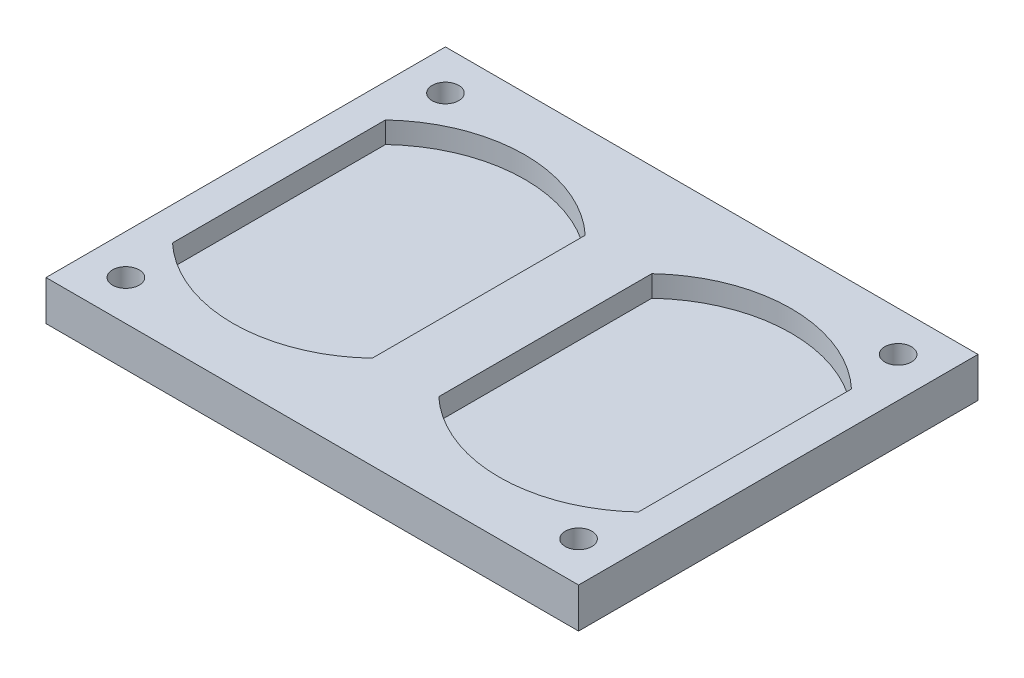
ISO-10303-21;
HEADER;
FILE_DESCRIPTION(('STEP AP214'),'2;1');
FILE_NAME('part.step','',(''),(''),'','','');
FILE_SCHEMA(('AUTOMOTIVE_DESIGN { 1 0 10303 214 1 1 1 1 }'));
ENDSEC;
DATA;
#1=APPLICATION_CONTEXT('core data for automotive mechanical design processes');
#2=APPLICATION_PROTOCOL_DEFINITION('international standard','automotive_design',2000,#1);
#3=PRODUCT_CONTEXT('',#1,'mechanical');
#4=PRODUCT('Part','Part','',(#3));
#5=PRODUCT_RELATED_PRODUCT_CATEGORY('part','',(#4));
#6=PRODUCT_DEFINITION_FORMATION('','',#4);
#7=PRODUCT_DEFINITION_CONTEXT('part definition',#1,'design');
#8=PRODUCT_DEFINITION('design','',#6,#7);
#9=PRODUCT_DEFINITION_SHAPE('','',#8);
#10=(LENGTH_UNIT() NAMED_UNIT(*) SI_UNIT(.MILLI.,.METRE.));
#11=(NAMED_UNIT(*) PLANE_ANGLE_UNIT() SI_UNIT($,.RADIAN.));
#12=(NAMED_UNIT(*) SI_UNIT($,.STERADIAN.) SOLID_ANGLE_UNIT());
#13=UNCERTAINTY_MEASURE_WITH_UNIT(LENGTH_MEASURE(1.E-05),#10,'distance_accuracy_value','');
#14=(GEOMETRIC_REPRESENTATION_CONTEXT(3) GLOBAL_UNCERTAINTY_ASSIGNED_CONTEXT((#13)) GLOBAL_UNIT_ASSIGNED_CONTEXT((#10,
#11,#12)) REPRESENTATION_CONTEXT('',''));
#15=CARTESIAN_POINT('',(0.,0.,0.));
#16=DIRECTION('',(0.,0.,1.));
#17=DIRECTION('',(1.,0.,0.));
#18=AXIS2_PLACEMENT_3D('',#15,#16,#17);
#19=CARTESIAN_POINT('',(100.,15.,75.));
#20=DIRECTION('',(-1.,0.,0.));
#21=DIRECTION('',(0.,0.,1.));
#22=AXIS2_PLACEMENT_3D('',#19,#20,#21);
#23=PLANE('',#22);
#24=DIRECTION('',(0.,0.,-1.));
#25=VECTOR('',#24,1.);
#26=CARTESIAN_POINT('',(100.,0.,75.));
#27=LINE('',#26,#25);
#28=CARTESIAN_POINT('',(100.,0.,75.));
#29=VERTEX_POINT('',#28);
#30=CARTESIAN_POINT('',(100.,0.,-75.));
#31=VERTEX_POINT('',#30);
#32=EDGE_CURVE('E187',#29,#31,#27,.T.);
#33=ORIENTED_EDGE('',*,*,#32,.T.);
#34=DIRECTION('',(0.,-1.,0.));
#35=VECTOR('',#34,1.);
#36=CARTESIAN_POINT('',(100.,15.,-75.));
#37=LINE('',#36,#35);
#38=CARTESIAN_POINT('',(100.,15.,-75.));
#39=VERTEX_POINT('',#38);
#40=EDGE_CURVE('E12',#39,#31,#37,.T.);
#41=ORIENTED_EDGE('',*,*,#40,.F.);
#42=DIRECTION('',(0.,0.,-1.));
#43=VECTOR('',#42,1.);
#44=CARTESIAN_POINT('',(100.,15.,75.));
#45=LINE('',#44,#43);
#46=CARTESIAN_POINT('',(100.,15.,75.));
#47=VERTEX_POINT('',#46);
#48=EDGE_CURVE('E244',#47,#39,#45,.T.);
#49=ORIENTED_EDGE('',*,*,#48,.F.);
#50=DIRECTION('',(0.,-1.,0.));
#51=VECTOR('',#50,1.);
#52=CARTESIAN_POINT('',(100.,15.,75.));
#53=LINE('',#52,#51);
#54=EDGE_CURVE('E254',#47,#29,#53,.T.);
#55=ORIENTED_EDGE('',*,*,#54,.T.);
#56=EDGE_LOOP('',(#33,#41,#49,#55));
#57=FACE_BOUND('',#56,.T.);
#58=ADVANCED_FACE('F39',(#57),#23,.F.);
#59=CARTESIAN_POINT('',(-100.,15.,-75.));
#60=DIRECTION('',(0.,0.,1.));
#61=DIRECTION('',(1.,0.,0.));
#62=AXIS2_PLACEMENT_3D('',#59,#60,#61);
#63=PLANE('',#62);
#64=DIRECTION('',(-1.,0.,0.));
#65=VECTOR('',#64,1.);
#66=CARTESIAN_POINT('',(-100.,0.,-75.));
#67=LINE('',#66,#65);
#68=CARTESIAN_POINT('',(-100.,0.,-75.));
#69=VERTEX_POINT('',#68);
#70=EDGE_CURVE('E257',#31,#69,#67,.T.);
#71=ORIENTED_EDGE('',*,*,#70,.T.);
#72=DIRECTION('',(0.,-1.,0.));
#73=VECTOR('',#72,1.);
#74=CARTESIAN_POINT('',(-100.,15.,-75.));
#75=LINE('',#74,#73);
#76=CARTESIAN_POINT('',(-100.,15.,-75.));
#77=VERTEX_POINT('',#76);
#78=EDGE_CURVE('E46',#77,#69,#75,.T.);
#79=ORIENTED_EDGE('',*,*,#78,.F.);
#80=DIRECTION('',(-1.,0.,0.));
#81=VECTOR('',#80,1.);
#82=CARTESIAN_POINT('',(-100.,15.,-75.));
#83=LINE('',#82,#81);
#84=EDGE_CURVE('E247',#39,#77,#83,.T.);
#85=ORIENTED_EDGE('',*,*,#84,.F.);
#86=ORIENTED_EDGE('',*,*,#40,.T.);
#87=EDGE_LOOP('',(#71,#79,#85,#86));
#88=FACE_BOUND('',#87,.T.);
#89=ADVANCED_FACE('F288',(#88),#63,.F.);
#90=CARTESIAN_POINT('',(-100.,15.,75.));
#91=DIRECTION('',(1.,0.,0.));
#92=DIRECTION('',(0.,0.,-1.));
#93=AXIS2_PLACEMENT_3D('',#90,#91,#92);
#94=PLANE('',#93);
#95=DIRECTION('',(0.,0.,1.));
#96=VECTOR('',#95,1.);
#97=CARTESIAN_POINT('',(-100.,0.,75.));
#98=LINE('',#97,#96);
#99=CARTESIAN_POINT('',(-100.,0.,75.));
#100=VERTEX_POINT('',#99);
#101=EDGE_CURVE('E259',#69,#100,#98,.T.);
#102=ORIENTED_EDGE('',*,*,#101,.T.);
#103=DIRECTION('',(0.,-1.,0.));
#104=VECTOR('',#103,1.);
#105=CARTESIAN_POINT('',(-100.,15.,75.));
#106=LINE('',#105,#104);
#107=CARTESIAN_POINT('',(-100.,15.,75.));
#108=VERTEX_POINT('',#107);
#109=EDGE_CURVE('E263',#108,#100,#106,.T.);
#110=ORIENTED_EDGE('',*,*,#109,.F.);
#111=DIRECTION('',(0.,0.,1.));
#112=VECTOR('',#111,1.);
#113=CARTESIAN_POINT('',(-100.,15.,75.));
#114=LINE('',#113,#112);
#115=EDGE_CURVE('E250',#77,#108,#114,.T.);
#116=ORIENTED_EDGE('',*,*,#115,.F.);
#117=ORIENTED_EDGE('',*,*,#78,.T.);
#118=EDGE_LOOP('',(#102,#110,#116,#117));
#119=FACE_BOUND('',#118,.T.);
#120=ADVANCED_FACE('F272',(#119),#94,.F.);
#121=CARTESIAN_POINT('',(-100.,15.,75.));
#122=DIRECTION('',(0.,0.,-1.));
#123=DIRECTION('',(-1.,0.,0.));
#124=AXIS2_PLACEMENT_3D('',#121,#122,#123);
#125=PLANE('',#124);
#126=DIRECTION('',(1.,0.,0.));
#127=VECTOR('',#126,1.);
#128=CARTESIAN_POINT('',(-100.,0.,75.));
#129=LINE('',#128,#127);
#130=EDGE_CURVE('E248',#100,#29,#129,.T.);
#131=ORIENTED_EDGE('',*,*,#130,.T.);
#132=ORIENTED_EDGE('',*,*,#54,.F.);
#133=DIRECTION('',(1.,0.,0.));
#134=VECTOR('',#133,1.);
#135=CARTESIAN_POINT('',(-100.,15.,75.));
#136=LINE('',#135,#134);
#137=EDGE_CURVE('E252',#108,#47,#136,.T.);
#138=ORIENTED_EDGE('',*,*,#137,.F.);
#139=ORIENTED_EDGE('',*,*,#109,.T.);
#140=EDGE_LOOP('',(#131,#132,#138,#139));
#141=FACE_BOUND('',#140,.T.);
#142=ADVANCED_FACE('F281',(#141),#125,.F.);
#143=CARTESIAN_POINT('',(0.,15.,0.));
#144=DIRECTION('',(0.,-1.,0.));
#145=DIRECTION('',(0.,0.,-1.));
#146=AXIS2_PLACEMENT_3D('',#143,#144,#145);
#147=PLANE('',#146);
#148=CARTESIAN_POINT('',(-85.,15.,-60.));
#149=DIRECTION('',(0.,1.,0.));
#150=DIRECTION('',(0.,0.,1.));
#151=AXIS2_PLACEMENT_3D('',#148,#149,#150);
#152=CIRCLE('',#151,5.);
#153=CARTESIAN_POINT('',(-85.,15.,-55.));
#154=VERTEX_POINT('',#153);
#155=EDGE_CURVE('E360',#154,#154,#152,.T.);
#156=ORIENTED_EDGE('',*,*,#155,.F.);
#157=EDGE_LOOP('',(#156));
#158=FACE_BOUND('',#157,.T.);
#159=CARTESIAN_POINT('',(85.,15.,-60.));
#160=DIRECTION('',(0.,1.,0.));
#161=DIRECTION('',(0.,0.,1.));
#162=AXIS2_PLACEMENT_3D('',#159,#160,#161);
#163=CIRCLE('',#162,5.);
#164=CARTESIAN_POINT('',(85.,15.,-55.));
#165=VERTEX_POINT('',#164);
#166=EDGE_CURVE('E362',#165,#165,#163,.T.);
#167=ORIENTED_EDGE('',*,*,#166,.F.);
#168=EDGE_LOOP('',(#167));
#169=FACE_BOUND('',#168,.T.);
#170=CARTESIAN_POINT('',(85.,15.,60.));
#171=DIRECTION('',(0.,1.,0.));
#172=DIRECTION('',(0.,0.,1.));
#173=AXIS2_PLACEMENT_3D('',#170,#171,#172);
#174=CIRCLE('',#173,5.);
#175=CARTESIAN_POINT('',(85.,15.,65.));
#176=VERTEX_POINT('',#175);
#177=EDGE_CURVE('E370',#176,#176,#174,.T.);
#178=ORIENTED_EDGE('',*,*,#177,.F.);
#179=EDGE_LOOP('',(#178));
#180=FACE_BOUND('',#179,.T.);
#181=CARTESIAN_POINT('',(-85.,15.,60.));
#182=DIRECTION('',(0.,1.,0.));
#183=DIRECTION('',(0.,0.,1.));
#184=AXIS2_PLACEMENT_3D('',#181,#182,#183);
#185=CIRCLE('',#184,5.);
#186=CARTESIAN_POINT('',(-85.,15.,65.));
#187=VERTEX_POINT('',#186);
#188=EDGE_CURVE('E375',#187,#187,#185,.T.);
#189=ORIENTED_EDGE('',*,*,#188,.F.);
#190=EDGE_LOOP('',(#189));
#191=FACE_BOUND('',#190,.T.);
#192=DIRECTION('',(0.,0.,1.));
#193=VECTOR('',#192,1.);
#194=CARTESIAN_POINT('',(-87.5,15.,40.0000000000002));
#195=LINE('',#194,#193);
#196=CARTESIAN_POINT('',(-87.5,15.,-39.9999999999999));
#197=VERTEX_POINT('',#196);
#198=CARTESIAN_POINT('',(-87.4999999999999,15.,40.0000000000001));
#199=VERTEX_POINT('',#198);
#200=EDGE_CURVE('E171',#197,#199,#195,.T.);
#201=ORIENTED_EDGE('',*,*,#200,.F.);
#202=CARTESIAN_POINT('',(-50.,15.,0.));
#203=DIRECTION('',(0.,1.,0.));
#204=DIRECTION('',(0.,0.,-1.));
#205=AXIS2_PLACEMENT_3D('',#202,#203,#204);
#206=CIRCLE('',#205,54.8292804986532);
#207=CARTESIAN_POINT('',(-12.5,15.,-39.9999999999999));
#208=VERTEX_POINT('',#207);
#209=EDGE_CURVE('E53',#208,#197,#206,.T.);
#210=ORIENTED_EDGE('',*,*,#209,.F.);
#211=DIRECTION('',(0.,0.,-1.));
#212=VECTOR('',#211,1.);
#213=CARTESIAN_POINT('',(-12.5,15.,39.9999999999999));
#214=LINE('',#213,#212);
#215=CARTESIAN_POINT('',(-12.5,15.,39.9999999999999));
#216=VERTEX_POINT('',#215);
#217=EDGE_CURVE('E147',#216,#208,#214,.T.);
#218=ORIENTED_EDGE('',*,*,#217,.F.);
#219=CARTESIAN_POINT('',(-50.,15.,0.));
#220=DIRECTION('',(0.,1.,0.));
#221=DIRECTION('',(0.,0.,-1.));
#222=AXIS2_PLACEMENT_3D('',#219,#220,#221);
#223=CIRCLE('',#222,54.8292804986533);
#224=EDGE_CURVE('E150',#199,#216,#223,.T.);
#225=ORIENTED_EDGE('',*,*,#224,.F.);
#226=EDGE_LOOP('',(#201,#210,#218,#225));
#227=FACE_BOUND('',#226,.T.);
#228=DIRECTION('',(0.,0.,-1.));
#229=VECTOR('',#228,1.);
#230=CARTESIAN_POINT('',(87.5000000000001,15.,40.0000000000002));
#231=LINE('',#230,#229);
#232=CARTESIAN_POINT('',(87.5000000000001,15.,40.0000000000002));
#233=VERTEX_POINT('',#232);
#234=CARTESIAN_POINT('',(87.5000000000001,15.,-39.9999999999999));
#235=VERTEX_POINT('',#234);
#236=EDGE_CURVE('E221',#233,#235,#231,.T.);
#237=ORIENTED_EDGE('',*,*,#236,.F.);
#238=CARTESIAN_POINT('',(50.,15.,0.));
#239=DIRECTION('',(0.,1.,0.));
#240=DIRECTION('',(0.,0.,1.));
#241=AXIS2_PLACEMENT_3D('',#238,#239,#240);
#242=CIRCLE('',#241,54.8292804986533);
#243=CARTESIAN_POINT('',(12.5,15.,39.9999999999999));
#244=VERTEX_POINT('',#243);
#245=EDGE_CURVE('E61',#244,#233,#242,.T.);
#246=ORIENTED_EDGE('',*,*,#245,.F.);
#247=DIRECTION('',(0.,0.,1.));
#248=VECTOR('',#247,1.);
#249=CARTESIAN_POINT('',(12.5,15.,39.9999999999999));
#250=LINE('',#249,#248);
#251=CARTESIAN_POINT('',(12.5,15.,-39.9999999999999));
#252=VERTEX_POINT('',#251);
#253=EDGE_CURVE('E203',#252,#244,#250,.T.);
#254=ORIENTED_EDGE('',*,*,#253,.F.);
#255=CARTESIAN_POINT('',(50.,15.,0.));
#256=DIRECTION('',(0.,1.,0.));
#257=DIRECTION('',(0.,0.,1.));
#258=AXIS2_PLACEMENT_3D('',#255,#256,#257);
#259=CIRCLE('',#258,54.8292804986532);
#260=EDGE_CURVE('E228',#235,#252,#259,.T.);
#261=ORIENTED_EDGE('',*,*,#260,.F.);
#262=EDGE_LOOP('',(#237,#246,#254,#261));
#263=FACE_BOUND('',#262,.T.);
#264=ORIENTED_EDGE('',*,*,#48,.T.);
#265=ORIENTED_EDGE('',*,*,#84,.T.);
#266=ORIENTED_EDGE('',*,*,#115,.T.);
#267=ORIENTED_EDGE('',*,*,#137,.T.);
#268=EDGE_LOOP('',(#264,#265,#266,#267));
#269=FACE_BOUND('',#268,.T.);
#270=ADVANCED_FACE('F287',(#158,#169,#180,#191,#227,#263,#269),#147,.F.);
#271=CARTESIAN_POINT('',(0.,0.,0.));
#272=DIRECTION('',(0.,-1.,0.));
#273=DIRECTION('',(0.,0.,-1.));
#274=AXIS2_PLACEMENT_3D('',#271,#272,#273);
#275=PLANE('',#274);
#276=CARTESIAN_POINT('',(-85.,0.,-60.));
#277=DIRECTION('',(0.,1.,0.));
#278=DIRECTION('',(0.,0.,1.));
#279=AXIS2_PLACEMENT_3D('',#276,#277,#278);
#280=CIRCLE('',#279,5.);
#281=CARTESIAN_POINT('',(-85.,0.,-55.));
#282=VERTEX_POINT('',#281);
#283=EDGE_CURVE('E357',#282,#282,#280,.T.);
#284=ORIENTED_EDGE('',*,*,#283,.T.);
#285=EDGE_LOOP('',(#284));
#286=FACE_BOUND('',#285,.T.);
#287=CARTESIAN_POINT('',(85.,0.,-60.));
#288=DIRECTION('',(0.,1.,0.));
#289=DIRECTION('',(0.,0.,1.));
#290=AXIS2_PLACEMENT_3D('',#287,#288,#289);
#291=CIRCLE('',#290,5.);
#292=CARTESIAN_POINT('',(85.,0.,-55.));
#293=VERTEX_POINT('',#292);
#294=EDGE_CURVE('E367',#293,#293,#291,.T.);
#295=ORIENTED_EDGE('',*,*,#294,.T.);
#296=EDGE_LOOP('',(#295));
#297=FACE_BOUND('',#296,.T.);
#298=CARTESIAN_POINT('',(85.,0.,60.));
#299=DIRECTION('',(0.,1.,0.));
#300=DIRECTION('',(0.,0.,1.));
#301=AXIS2_PLACEMENT_3D('',#298,#299,#300);
#302=CIRCLE('',#301,5.);
#303=CARTESIAN_POINT('',(85.,0.,65.));
#304=VERTEX_POINT('',#303);
#305=EDGE_CURVE('E373',#304,#304,#302,.T.);
#306=ORIENTED_EDGE('',*,*,#305,.T.);
#307=EDGE_LOOP('',(#306));
#308=FACE_BOUND('',#307,.T.);
#309=CARTESIAN_POINT('',(-85.,0.,60.));
#310=DIRECTION('',(0.,1.,0.));
#311=DIRECTION('',(0.,0.,1.));
#312=AXIS2_PLACEMENT_3D('',#309,#310,#311);
#313=CIRCLE('',#312,5.);
#314=CARTESIAN_POINT('',(-85.,0.,65.));
#315=VERTEX_POINT('',#314);
#316=EDGE_CURVE('E154',#315,#315,#313,.T.);
#317=ORIENTED_EDGE('',*,*,#316,.T.);
#318=EDGE_LOOP('',(#317));
#319=FACE_BOUND('',#318,.T.);
#320=ORIENTED_EDGE('',*,*,#32,.F.);
#321=ORIENTED_EDGE('',*,*,#130,.F.);
#322=ORIENTED_EDGE('',*,*,#101,.F.);
#323=ORIENTED_EDGE('',*,*,#70,.F.);
#324=EDGE_LOOP('',(#320,#321,#322,#323));
#325=FACE_BOUND('',#324,.T.);
#326=ADVANCED_FACE('F278',(#286,#297,#308,#319,#325),#275,.T.);
#327=CARTESIAN_POINT('',(50.,7.,0.));
#328=DIRECTION('',(0.,1.,0.));
#329=DIRECTION('',(0.,0.,1.));
#330=AXIS2_PLACEMENT_3D('',#327,#328,#329);
#331=CYLINDRICAL_SURFACE('',#330,54.8292804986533);
#332=ORIENTED_EDGE('',*,*,#245,.T.);
#333=DIRECTION('',(0.,1.,0.));
#334=VECTOR('',#333,1.);
#335=CARTESIAN_POINT('',(87.5000000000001,7.,40.0000000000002));
#336=LINE('',#335,#334);
#337=CARTESIAN_POINT('',(87.5000000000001,7.,40.0000000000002));
#338=VERTEX_POINT('',#337);
#339=EDGE_CURVE('E218',#338,#233,#336,.T.);
#340=ORIENTED_EDGE('',*,*,#339,.F.);
#341=CARTESIAN_POINT('',(50.,7.,0.));
#342=DIRECTION('',(0.,1.,0.));
#343=DIRECTION('',(0.,0.,1.));
#344=AXIS2_PLACEMENT_3D('',#341,#342,#343);
#345=CIRCLE('',#344,54.8292804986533);
#346=CARTESIAN_POINT('',(12.5,7.,39.9999999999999));
#347=VERTEX_POINT('',#346);
#348=EDGE_CURVE('E198',#347,#338,#345,.T.);
#349=ORIENTED_EDGE('',*,*,#348,.F.);
#350=DIRECTION('',(0.,1.,0.));
#351=VECTOR('',#350,1.);
#352=CARTESIAN_POINT('',(12.5,7.,39.9999999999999));
#353=LINE('',#352,#351);
#354=EDGE_CURVE('E172',#347,#244,#353,.T.);
#355=ORIENTED_EDGE('',*,*,#354,.T.);
#356=EDGE_LOOP('',(#332,#340,#349,#355));
#357=FACE_BOUND('',#356,.T.);
#358=ADVANCED_FACE('F300',(#357),#331,.F.);
#359=CARTESIAN_POINT('',(12.5,7.,39.9999999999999));
#360=DIRECTION('',(-1.,0.,0.));
#361=DIRECTION('',(0.,0.,1.));
#362=AXIS2_PLACEMENT_3D('',#359,#360,#361);
#363=PLANE('',#362);
#364=ORIENTED_EDGE('',*,*,#253,.T.);
#365=ORIENTED_EDGE('',*,*,#354,.F.);
#366=DIRECTION('',(0.,0.,1.));
#367=VECTOR('',#366,1.);
#368=CARTESIAN_POINT('',(12.5,7.,39.9999999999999));
#369=LINE('',#368,#367);
#370=CARTESIAN_POINT('',(12.5,7.,-39.9999999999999));
#371=VERTEX_POINT('',#370);
#372=EDGE_CURVE('E214',#371,#347,#369,.T.);
#373=ORIENTED_EDGE('',*,*,#372,.F.);
#374=DIRECTION('',(0.,1.,0.));
#375=VECTOR('',#374,1.);
#376=CARTESIAN_POINT('',(12.5,7.,-39.9999999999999));
#377=LINE('',#376,#375);
#378=EDGE_CURVE('E235',#371,#252,#377,.T.);
#379=ORIENTED_EDGE('',*,*,#378,.T.);
#380=EDGE_LOOP('',(#364,#365,#373,#379));
#381=FACE_BOUND('',#380,.T.);
#382=ADVANCED_FACE('F307',(#381),#363,.F.);
#383=CARTESIAN_POINT('',(50.,7.,0.));
#384=DIRECTION('',(0.,1.,0.));
#385=DIRECTION('',(0.,0.,1.));
#386=AXIS2_PLACEMENT_3D('',#383,#384,#385);
#387=CYLINDRICAL_SURFACE('',#386,54.8292804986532);
#388=ORIENTED_EDGE('',*,*,#260,.T.);
#389=ORIENTED_EDGE('',*,*,#378,.F.);
#390=CARTESIAN_POINT('',(50.,7.,0.));
#391=DIRECTION('',(0.,1.,0.));
#392=DIRECTION('',(0.,0.,1.));
#393=AXIS2_PLACEMENT_3D('',#390,#391,#392);
#394=CIRCLE('',#393,54.8292804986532);
#395=CARTESIAN_POINT('',(87.5000000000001,7.,-39.9999999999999));
#396=VERTEX_POINT('',#395);
#397=EDGE_CURVE('E211',#396,#371,#394,.T.);
#398=ORIENTED_EDGE('',*,*,#397,.F.);
#399=DIRECTION('',(0.,1.,0.));
#400=VECTOR('',#399,1.);
#401=CARTESIAN_POINT('',(87.5000000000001,7.,-39.9999999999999));
#402=LINE('',#401,#400);
#403=EDGE_CURVE('E240',#396,#235,#402,.T.);
#404=ORIENTED_EDGE('',*,*,#403,.T.);
#405=EDGE_LOOP('',(#388,#389,#398,#404));
#406=FACE_BOUND('',#405,.T.);
#407=ADVANCED_FACE('F312',(#406),#387,.F.);
#408=CARTESIAN_POINT('',(87.5000000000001,7.,40.0000000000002));
#409=DIRECTION('',(1.,0.,0.));
#410=DIRECTION('',(0.,0.,-1.));
#411=AXIS2_PLACEMENT_3D('',#408,#409,#410);
#412=PLANE('',#411);
#413=ORIENTED_EDGE('',*,*,#236,.T.);
#414=ORIENTED_EDGE('',*,*,#403,.F.);
#415=DIRECTION('',(0.,0.,-1.));
#416=VECTOR('',#415,1.);
#417=CARTESIAN_POINT('',(87.5000000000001,7.,40.0000000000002));
#418=LINE('',#417,#416);
#419=EDGE_CURVE('E202',#338,#396,#418,.T.);
#420=ORIENTED_EDGE('',*,*,#419,.F.);
#421=ORIENTED_EDGE('',*,*,#339,.T.);
#422=EDGE_LOOP('',(#413,#414,#420,#421));
#423=FACE_BOUND('',#422,.T.);
#424=ADVANCED_FACE('F308',(#423),#412,.F.);
#425=CARTESIAN_POINT('',(50.,7.,0.));
#426=DIRECTION('',(0.,1.,0.));
#427=DIRECTION('',(0.,0.,1.));
#428=AXIS2_PLACEMENT_3D('',#425,#426,#427);
#429=PLANE('',#428);
#430=ORIENTED_EDGE('',*,*,#348,.T.);
#431=ORIENTED_EDGE('',*,*,#419,.T.);
#432=ORIENTED_EDGE('',*,*,#397,.T.);
#433=ORIENTED_EDGE('',*,*,#372,.T.);
#434=EDGE_LOOP('',(#430,#431,#432,#433));
#435=FACE_BOUND('',#434,.T.);
#436=ADVANCED_FACE('F311',(#435),#429,.T.);
#437=CARTESIAN_POINT('',(-50.,7.,0.));
#438=DIRECTION('',(0.,1.,0.));
#439=DIRECTION('',(0.,0.,1.));
#440=AXIS2_PLACEMENT_3D('',#437,#438,#439);
#441=CYLINDRICAL_SURFACE('',#440,54.8292804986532);
#442=ORIENTED_EDGE('',*,*,#209,.T.);
#443=DIRECTION('',(0.,1.,0.));
#444=VECTOR('',#443,1.);
#445=CARTESIAN_POINT('',(-87.5,7.,-39.9999999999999));
#446=LINE('',#445,#444);
#447=CARTESIAN_POINT('',(-87.5,7.,-39.9999999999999));
#448=VERTEX_POINT('',#447);
#449=EDGE_CURVE('E125',#448,#197,#446,.T.);
#450=ORIENTED_EDGE('',*,*,#449,.F.);
#451=CARTESIAN_POINT('',(-50.,7.,0.));
#452=DIRECTION('',(0.,1.,0.));
#453=DIRECTION('',(0.,0.,-1.));
#454=AXIS2_PLACEMENT_3D('',#451,#452,#453);
#455=CIRCLE('',#454,54.8292804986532);
#456=CARTESIAN_POINT('',(-12.5,7.,-39.9999999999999));
#457=VERTEX_POINT('',#456);
#458=EDGE_CURVE('E129',#457,#448,#455,.T.);
#459=ORIENTED_EDGE('',*,*,#458,.F.);
#460=DIRECTION('',(0.,1.,0.));
#461=VECTOR('',#460,1.);
#462=CARTESIAN_POINT('',(-12.5,7.,-39.9999999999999));
#463=LINE('',#462,#461);
#464=EDGE_CURVE('E184',#457,#208,#463,.T.);
#465=ORIENTED_EDGE('',*,*,#464,.T.);
#466=EDGE_LOOP('',(#442,#450,#459,#465));
#467=FACE_BOUND('',#466,.T.);
#468=ADVANCED_FACE('F127',(#467),#441,.F.);
#469=CARTESIAN_POINT('',(-12.5,7.,39.9999999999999));
#470=DIRECTION('',(1.,0.,0.));
#471=DIRECTION('',(0.,0.,-1.));
#472=AXIS2_PLACEMENT_3D('',#469,#470,#471);
#473=PLANE('',#472);
#474=ORIENTED_EDGE('',*,*,#217,.T.);
#475=ORIENTED_EDGE('',*,*,#464,.F.);
#476=DIRECTION('',(0.,0.,-1.));
#477=VECTOR('',#476,1.);
#478=CARTESIAN_POINT('',(-12.5,7.,39.9999999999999));
#479=LINE('',#478,#477);
#480=CARTESIAN_POINT('',(-12.5,7.,39.9999999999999));
#481=VERTEX_POINT('',#480);
#482=EDGE_CURVE('E135',#481,#457,#479,.T.);
#483=ORIENTED_EDGE('',*,*,#482,.F.);
#484=DIRECTION('',(0.,1.,0.));
#485=VECTOR('',#484,1.);
#486=CARTESIAN_POINT('',(-12.5,7.,39.9999999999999));
#487=LINE('',#486,#485);
#488=EDGE_CURVE('E188',#481,#216,#487,.T.);
#489=ORIENTED_EDGE('',*,*,#488,.T.);
#490=EDGE_LOOP('',(#474,#475,#483,#489));
#491=FACE_BOUND('',#490,.T.);
#492=ADVANCED_FACE('F325',(#491),#473,.F.);
#493=CARTESIAN_POINT('',(-50.,7.,0.));
#494=DIRECTION('',(0.,1.,0.));
#495=DIRECTION('',(0.,0.,1.));
#496=AXIS2_PLACEMENT_3D('',#493,#494,#495);
#497=CYLINDRICAL_SURFACE('',#496,54.8292804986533);
#498=ORIENTED_EDGE('',*,*,#224,.T.);
#499=ORIENTED_EDGE('',*,*,#488,.F.);
#500=CARTESIAN_POINT('',(-50.,7.,0.));
#501=DIRECTION('',(0.,1.,0.));
#502=DIRECTION('',(0.,0.,-1.));
#503=AXIS2_PLACEMENT_3D('',#500,#501,#502);
#504=CIRCLE('',#503,54.8292804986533);
#505=CARTESIAN_POINT('',(-87.4999999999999,7.,40.0000000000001));
#506=VERTEX_POINT('',#505);
#507=EDGE_CURVE('E143',#506,#481,#504,.T.);
#508=ORIENTED_EDGE('',*,*,#507,.F.);
#509=DIRECTION('',(0.,1.,0.));
#510=VECTOR('',#509,1.);
#511=CARTESIAN_POINT('',(-87.4999999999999,7.,40.0000000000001));
#512=LINE('',#511,#510);
#513=EDGE_CURVE('E134',#506,#199,#512,.T.);
#514=ORIENTED_EDGE('',*,*,#513,.T.);
#515=EDGE_LOOP('',(#498,#499,#508,#514));
#516=FACE_BOUND('',#515,.T.);
#517=ADVANCED_FACE('F328',(#516),#497,.F.);
#518=CARTESIAN_POINT('',(-87.5,7.,40.0000000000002));
#519=DIRECTION('',(-1.,0.,0.));
#520=DIRECTION('',(0.,0.,1.));
#521=AXIS2_PLACEMENT_3D('',#518,#519,#520);
#522=PLANE('',#521);
#523=ORIENTED_EDGE('',*,*,#200,.T.);
#524=ORIENTED_EDGE('',*,*,#513,.F.);
#525=DIRECTION('',(0.,0.,1.));
#526=VECTOR('',#525,1.);
#527=CARTESIAN_POINT('',(-87.5,7.,40.0000000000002));
#528=LINE('',#527,#526);
#529=EDGE_CURVE('E138',#448,#506,#528,.T.);
#530=ORIENTED_EDGE('',*,*,#529,.F.);
#531=ORIENTED_EDGE('',*,*,#449,.T.);
#532=EDGE_LOOP('',(#523,#524,#530,#531));
#533=FACE_BOUND('',#532,.T.);
#534=ADVANCED_FACE('F139',(#533),#522,.F.);
#535=CARTESIAN_POINT('',(-50.,7.,0.));
#536=DIRECTION('',(0.,-1.,0.));
#537=DIRECTION('',(0.,0.,-1.));
#538=AXIS2_PLACEMENT_3D('',#535,#536,#537);
#539=PLANE('',#538);
#540=ORIENTED_EDGE('',*,*,#458,.T.);
#541=ORIENTED_EDGE('',*,*,#529,.T.);
#542=ORIENTED_EDGE('',*,*,#507,.T.);
#543=ORIENTED_EDGE('',*,*,#482,.T.);
#544=EDGE_LOOP('',(#540,#541,#542,#543));
#545=FACE_BOUND('',#544,.T.);
#546=ADVANCED_FACE('F145',(#545),#539,.F.);
#547=CARTESIAN_POINT('',(-85.,15.,60.));
#548=DIRECTION('',(0.,1.,0.));
#549=DIRECTION('',(0.,0.,1.));
#550=AXIS2_PLACEMENT_3D('',#547,#548,#549);
#551=CYLINDRICAL_SURFACE('',#550,5.);
#552=ORIENTED_EDGE('',*,*,#316,.F.);
#553=EDGE_LOOP('',(#552));
#554=FACE_BOUND('',#553,.T.);
#555=ORIENTED_EDGE('',*,*,#188,.T.);
#556=EDGE_LOOP('',(#555));
#557=FACE_BOUND('',#556,.T.);
#558=ADVANCED_FACE('F337',(#554,#557),#551,.F.);
#559=CARTESIAN_POINT('',(85.,15.,60.));
#560=DIRECTION('',(0.,1.,0.));
#561=DIRECTION('',(0.,0.,1.));
#562=AXIS2_PLACEMENT_3D('',#559,#560,#561);
#563=CYLINDRICAL_SURFACE('',#562,5.);
#564=ORIENTED_EDGE('',*,*,#305,.F.);
#565=EDGE_LOOP('',(#564));
#566=FACE_BOUND('',#565,.T.);
#567=ORIENTED_EDGE('',*,*,#177,.T.);
#568=EDGE_LOOP('',(#567));
#569=FACE_BOUND('',#568,.T.);
#570=ADVANCED_FACE('F340',(#566,#569),#563,.F.);
#571=CARTESIAN_POINT('',(85.,15.,-60.));
#572=DIRECTION('',(0.,1.,0.));
#573=DIRECTION('',(0.,0.,1.));
#574=AXIS2_PLACEMENT_3D('',#571,#572,#573);
#575=CYLINDRICAL_SURFACE('',#574,5.);
#576=ORIENTED_EDGE('',*,*,#294,.F.);
#577=EDGE_LOOP('',(#576));
#578=FACE_BOUND('',#577,.T.);
#579=ORIENTED_EDGE('',*,*,#166,.T.);
#580=EDGE_LOOP('',(#579));
#581=FACE_BOUND('',#580,.T.);
#582=ADVANCED_FACE('F344',(#578,#581),#575,.F.);
#583=CARTESIAN_POINT('',(-85.,15.,-60.));
#584=DIRECTION('',(0.,1.,0.));
#585=DIRECTION('',(0.,0.,1.));
#586=AXIS2_PLACEMENT_3D('',#583,#584,#585);
#587=CYLINDRICAL_SURFACE('',#586,5.);
#588=ORIENTED_EDGE('',*,*,#283,.F.);
#589=EDGE_LOOP('',(#588));
#590=FACE_BOUND('',#589,.T.);
#591=ORIENTED_EDGE('',*,*,#155,.T.);
#592=EDGE_LOOP('',(#591));
#593=FACE_BOUND('',#592,.T.);
#594=ADVANCED_FACE('F348',(#590,#593),#587,.F.);
#595=CLOSED_SHELL('',(#58,#89,#120,#142,#270,#326,#358,#382,#407,#424,#436,#468,#492,#517,#534,
#546,#558,#570,#582,#594));
#596=MANIFOLD_SOLID_BREP('B2',#595);
#597=ADVANCED_BREP_SHAPE_REPRESENTATION('',(#18,#596),#14);
#598=SHAPE_DEFINITION_REPRESENTATION(#9,#597);
ENDSEC;
END-ISO-10303-21;
